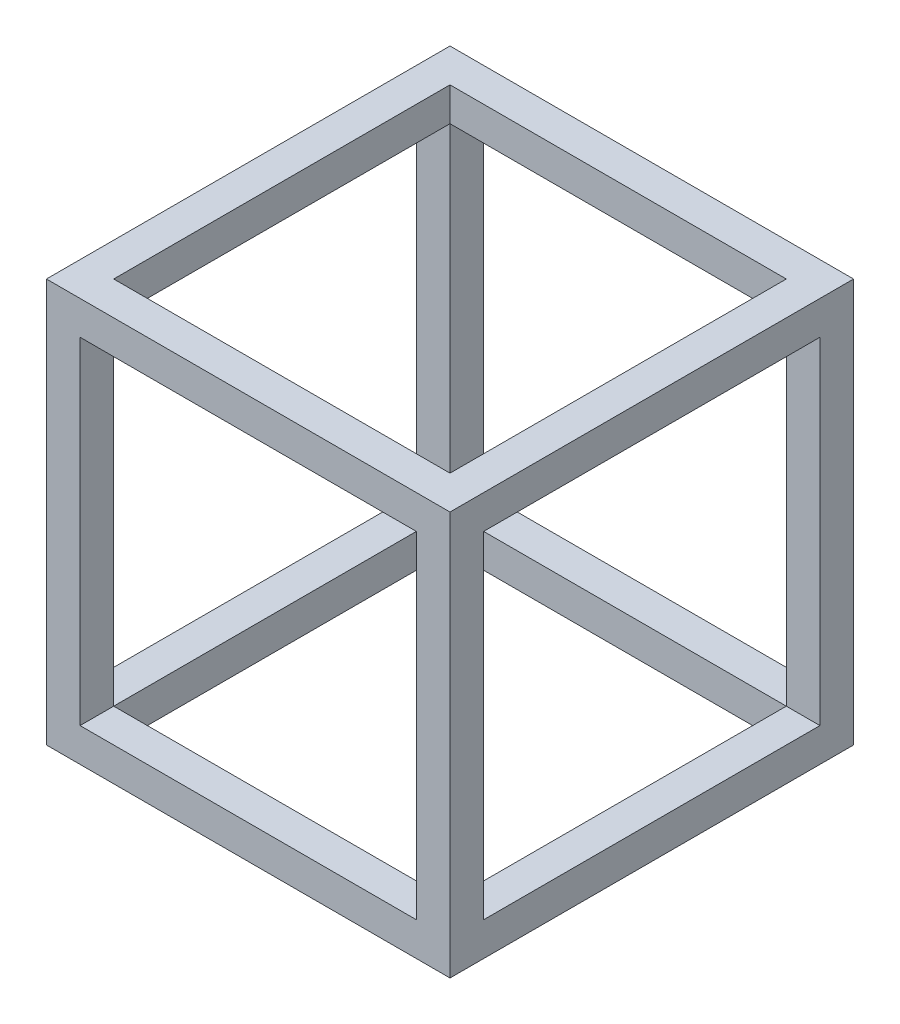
ISO-10303-21;
HEADER;
FILE_DESCRIPTION(('STEP AP214'),'2;1');
FILE_NAME('part.step','',(''),(''),'','','');
FILE_SCHEMA(('AUTOMOTIVE_DESIGN { 1 0 10303 214 1 1 1 1 }'));
ENDSEC;
DATA;
#1=APPLICATION_CONTEXT('core data for automotive mechanical design processes');
#2=APPLICATION_PROTOCOL_DEFINITION('international standard','automotive_design',2000,#1);
#3=PRODUCT_CONTEXT('',#1,'mechanical');
#4=PRODUCT('Part','Part','',(#3));
#5=PRODUCT_RELATED_PRODUCT_CATEGORY('part','',(#4));
#6=PRODUCT_DEFINITION_FORMATION('','',#4);
#7=PRODUCT_DEFINITION_CONTEXT('part definition',#1,'design');
#8=PRODUCT_DEFINITION('design','',#6,#7);
#9=PRODUCT_DEFINITION_SHAPE('','',#8);
#10=(LENGTH_UNIT() NAMED_UNIT(*) SI_UNIT(.MILLI.,.METRE.));
#11=(NAMED_UNIT(*) PLANE_ANGLE_UNIT() SI_UNIT($,.RADIAN.));
#12=(NAMED_UNIT(*) SI_UNIT($,.STERADIAN.) SOLID_ANGLE_UNIT());
#13=UNCERTAINTY_MEASURE_WITH_UNIT(LENGTH_MEASURE(1.E-05),#10,'distance_accuracy_value','');
#14=(GEOMETRIC_REPRESENTATION_CONTEXT(3) GLOBAL_UNCERTAINTY_ASSIGNED_CONTEXT((#13)) GLOBAL_UNIT_ASSIGNED_CONTEXT((#10,
#11,#12)) REPRESENTATION_CONTEXT('',''));
#15=CARTESIAN_POINT('',(0.,0.,0.));
#16=DIRECTION('',(0.,0.,1.));
#17=DIRECTION('',(1.,0.,0.));
#18=AXIS2_PLACEMENT_3D('',#15,#16,#17);
#19=CARTESIAN_POINT('',(-31.75,-38.1,31.75));
#20=DIRECTION('',(0.,0.,1.));
#21=DIRECTION('',(1.,0.,0.));
#22=AXIS2_PLACEMENT_3D('',#19,#20,#21);
#23=PLANE('',#22);
#24=DIRECTION('',(0.,1.,0.));
#25=VECTOR('',#24,1.);
#26=CARTESIAN_POINT('',(31.75,-38.1,31.75));
#27=LINE('',#26,#25);
#28=CARTESIAN_POINT('',(31.75,31.75,31.75));
#29=VERTEX_POINT('',#28);
#30=CARTESIAN_POINT('',(31.75,38.1,31.75));
#31=VERTEX_POINT('',#30);
#32=EDGE_CURVE('E312',#29,#31,#27,.T.);
#33=ORIENTED_EDGE('',*,*,#32,.F.);
#34=DIRECTION('',(-1.,0.,0.));
#35=VECTOR('',#34,1.);
#36=CARTESIAN_POINT('',(-31.75,31.75,31.75));
#37=LINE('',#36,#35);
#38=CARTESIAN_POINT('',(-31.75,31.75,31.75));
#39=VERTEX_POINT('',#38);
#40=EDGE_CURVE('E229',#29,#39,#37,.T.);
#41=ORIENTED_EDGE('',*,*,#40,.T.);
#42=DIRECTION('',(0.,1.,0.));
#43=VECTOR('',#42,1.);
#44=CARTESIAN_POINT('',(-31.75,-38.1,31.75));
#45=LINE('',#44,#43);
#46=CARTESIAN_POINT('',(-31.75,38.1,31.75));
#47=VERTEX_POINT('',#46);
#48=EDGE_CURVE('E316',#39,#47,#45,.T.);
#49=ORIENTED_EDGE('',*,*,#48,.T.);
#50=DIRECTION('',(1.,0.,0.));
#51=VECTOR('',#50,1.);
#52=CARTESIAN_POINT('',(-31.75,38.1,31.75));
#53=LINE('',#52,#51);
#54=EDGE_CURVE('E292',#47,#31,#53,.T.);
#55=ORIENTED_EDGE('',*,*,#54,.T.);
#56=EDGE_LOOP('',(#33,#41,#49,#55));
#57=FACE_BOUND('',#56,.T.);
#58=ADVANCED_FACE('F31',(#57),#23,.F.);
#59=DIRECTION('',(1.,0.,0.));
#60=VECTOR('',#59,1.);
#61=CARTESIAN_POINT('',(-38.1,-31.75,31.75));
#62=LINE('',#61,#60);
#63=CARTESIAN_POINT('',(31.75,-31.75,31.75));
#64=VERTEX_POINT('',#63);
#65=CARTESIAN_POINT('',(38.1,-31.75,31.75));
#66=VERTEX_POINT('',#65);
#67=EDGE_CURVE('E260',#64,#66,#62,.T.);
#68=ORIENTED_EDGE('',*,*,#67,.F.);
#69=DIRECTION('',(0.,1.,0.));
#70=VECTOR('',#69,1.);
#71=CARTESIAN_POINT('',(31.75,-38.1,31.75));
#72=LINE('',#71,#70);
#73=EDGE_CURVE('E220',#64,#29,#72,.T.);
#74=ORIENTED_EDGE('',*,*,#73,.T.);
#75=DIRECTION('',(1.,0.,0.));
#76=VECTOR('',#75,1.);
#77=CARTESIAN_POINT('',(-38.1,31.75,31.75));
#78=LINE('',#77,#76);
#79=CARTESIAN_POINT('',(38.1,31.75,31.75));
#80=VERTEX_POINT('',#79);
#81=EDGE_CURVE('E264',#29,#80,#78,.T.);
#82=ORIENTED_EDGE('',*,*,#81,.T.);
#83=DIRECTION('',(0.,-1.,0.));
#84=VECTOR('',#83,1.);
#85=CARTESIAN_POINT('',(38.1,31.75,31.75));
#86=LINE('',#85,#84);
#87=EDGE_CURVE('E240',#80,#66,#86,.T.);
#88=ORIENTED_EDGE('',*,*,#87,.T.);
#89=EDGE_LOOP('',(#68,#74,#82,#88));
#90=FACE_BOUND('',#89,.T.);
#91=ADVANCED_FACE('F381',(#90),#23,.F.);
#92=CARTESIAN_POINT('',(-31.75,-38.1,31.75));
#93=VERTEX_POINT('',#92);
#94=CARTESIAN_POINT('',(-31.75,-31.75,31.75));
#95=VERTEX_POINT('',#94);
#96=EDGE_CURVE('E313',#93,#95,#45,.T.);
#97=ORIENTED_EDGE('',*,*,#96,.T.);
#98=DIRECTION('',(1.,0.,0.));
#99=VECTOR('',#98,1.);
#100=CARTESIAN_POINT('',(-31.75,-31.75,31.75));
#101=LINE('',#100,#99);
#102=EDGE_CURVE('E178',#95,#64,#101,.T.);
#103=ORIENTED_EDGE('',*,*,#102,.T.);
#104=CARTESIAN_POINT('',(31.75,-38.1,31.75));
#105=VERTEX_POINT('',#104);
#106=EDGE_CURVE('E308',#105,#64,#27,.T.);
#107=ORIENTED_EDGE('',*,*,#106,.F.);
#108=DIRECTION('',(1.,0.,0.));
#109=VECTOR('',#108,1.);
#110=CARTESIAN_POINT('',(-31.75,-38.1,31.75));
#111=LINE('',#110,#109);
#112=EDGE_CURVE('E304',#93,#105,#111,.T.);
#113=ORIENTED_EDGE('',*,*,#112,.F.);
#114=EDGE_LOOP('',(#97,#103,#107,#113));
#115=FACE_BOUND('',#114,.T.);
#116=ADVANCED_FACE('F448',(#115),#23,.F.);
#117=CARTESIAN_POINT('',(31.75,-38.1,-31.75));
#118=DIRECTION('',(0.,0.,-1.));
#119=DIRECTION('',(-1.,0.,0.));
#120=AXIS2_PLACEMENT_3D('',#117,#118,#119);
#121=PLANE('',#120);
#122=DIRECTION('',(0.,1.,0.));
#123=VECTOR('',#122,1.);
#124=CARTESIAN_POINT('',(-31.75,-38.1,-31.75));
#125=LINE('',#124,#123);
#126=CARTESIAN_POINT('',(-31.75,31.75,-31.75));
#127=VERTEX_POINT('',#126);
#128=CARTESIAN_POINT('',(-31.75,38.1,-31.75));
#129=VERTEX_POINT('',#128);
#130=EDGE_CURVE('E320',#127,#129,#125,.T.);
#131=ORIENTED_EDGE('',*,*,#130,.F.);
#132=DIRECTION('',(1.,0.,0.));
#133=VECTOR('',#132,1.);
#134=CARTESIAN_POINT('',(31.75,31.75,-31.75));
#135=LINE('',#134,#133);
#136=CARTESIAN_POINT('',(31.75,31.75,-31.75));
#137=VERTEX_POINT('',#136);
#138=EDGE_CURVE('E11',#127,#137,#135,.T.);
#139=ORIENTED_EDGE('',*,*,#138,.T.);
#140=DIRECTION('',(0.,1.,0.));
#141=VECTOR('',#140,1.);
#142=CARTESIAN_POINT('',(31.75,-38.1,-31.75));
#143=LINE('',#142,#141);
#144=CARTESIAN_POINT('',(31.75,38.1,-31.75));
#145=VERTEX_POINT('',#144);
#146=EDGE_CURVE('E307',#137,#145,#143,.T.);
#147=ORIENTED_EDGE('',*,*,#146,.T.);
#148=DIRECTION('',(-1.,0.,0.));
#149=VECTOR('',#148,1.);
#150=CARTESIAN_POINT('',(31.75,38.1,-31.75));
#151=LINE('',#150,#149);
#152=EDGE_CURVE('E286',#145,#129,#151,.T.);
#153=ORIENTED_EDGE('',*,*,#152,.T.);
#154=EDGE_LOOP('',(#131,#139,#147,#153));
#155=FACE_BOUND('',#154,.T.);
#156=ADVANCED_FACE('F403',(#155),#121,.F.);
#157=DIRECTION('',(1.,0.,0.));
#158=VECTOR('',#157,1.);
#159=CARTESIAN_POINT('',(-38.1,31.75,-31.75));
#160=LINE('',#159,#158);
#161=CARTESIAN_POINT('',(38.1,31.75,-31.75));
#162=VERTEX_POINT('',#161);
#163=EDGE_CURVE('E268',#137,#162,#160,.T.);
#164=ORIENTED_EDGE('',*,*,#163,.F.);
#165=DIRECTION('',(0.,-1.,0.));
#166=VECTOR('',#165,1.);
#167=CARTESIAN_POINT('',(31.75,-38.1,-31.75));
#168=LINE('',#167,#166);
#169=CARTESIAN_POINT('',(31.75,-31.75,-31.75));
#170=VERTEX_POINT('',#169);
#171=EDGE_CURVE('E211',#137,#170,#168,.T.);
#172=ORIENTED_EDGE('',*,*,#171,.T.);
#173=DIRECTION('',(1.,0.,0.));
#174=VECTOR('',#173,1.);
#175=CARTESIAN_POINT('',(-38.1,-31.75,-31.75));
#176=LINE('',#175,#174);
#177=CARTESIAN_POINT('',(38.1,-31.75,-31.75));
#178=VERTEX_POINT('',#177);
#179=EDGE_CURVE('E255',#170,#178,#176,.T.);
#180=ORIENTED_EDGE('',*,*,#179,.T.);
#181=DIRECTION('',(0.,1.,0.));
#182=VECTOR('',#181,1.);
#183=CARTESIAN_POINT('',(38.1,-31.75,-31.75));
#184=LINE('',#183,#182);
#185=EDGE_CURVE('E234',#178,#162,#184,.T.);
#186=ORIENTED_EDGE('',*,*,#185,.T.);
#187=EDGE_LOOP('',(#164,#172,#180,#186));
#188=FACE_BOUND('',#187,.T.);
#189=ADVANCED_FACE('F392',(#188),#121,.F.);
#190=CARTESIAN_POINT('',(31.75,-38.1,-31.75));
#191=VERTEX_POINT('',#190);
#192=EDGE_CURVE('E321',#191,#170,#143,.T.);
#193=ORIENTED_EDGE('',*,*,#192,.T.);
#194=DIRECTION('',(-1.,0.,0.));
#195=VECTOR('',#194,1.);
#196=CARTESIAN_POINT('',(31.75,-31.75,-31.75));
#197=LINE('',#196,#195);
#198=CARTESIAN_POINT('',(-31.75,-31.75,-31.75));
#199=VERTEX_POINT('',#198);
#200=EDGE_CURVE('E39',#170,#199,#197,.T.);
#201=ORIENTED_EDGE('',*,*,#200,.T.);
#202=CARTESIAN_POINT('',(-31.75,-38.1,-31.75));
#203=VERTEX_POINT('',#202);
#204=EDGE_CURVE('E317',#203,#199,#125,.T.);
#205=ORIENTED_EDGE('',*,*,#204,.F.);
#206=DIRECTION('',(-1.,0.,0.));
#207=VECTOR('',#206,1.);
#208=CARTESIAN_POINT('',(31.75,-38.1,-31.75));
#209=LINE('',#208,#207);
#210=EDGE_CURVE('E298',#191,#203,#209,.T.);
#211=ORIENTED_EDGE('',*,*,#210,.F.);
#212=EDGE_LOOP('',(#193,#201,#205,#211));
#213=FACE_BOUND('',#212,.T.);
#214=ADVANCED_FACE('F355',(#213),#121,.F.);
#215=CARTESIAN_POINT('',(31.75,-38.1,31.75));
#216=DIRECTION('',(1.,0.,0.));
#217=DIRECTION('',(0.,0.,-1.));
#218=AXIS2_PLACEMENT_3D('',#215,#216,#217);
#219=PLANE('',#218);
#220=ORIENTED_EDGE('',*,*,#106,.T.);
#221=DIRECTION('',(0.,0.,-1.));
#222=VECTOR('',#221,1.);
#223=CARTESIAN_POINT('',(31.75,-31.75,31.75));
#224=LINE('',#223,#222);
#225=EDGE_CURVE('E280',#64,#170,#224,.T.);
#226=ORIENTED_EDGE('',*,*,#225,.T.);
#227=ORIENTED_EDGE('',*,*,#192,.F.);
#228=DIRECTION('',(0.,0.,-1.));
#229=VECTOR('',#228,1.);
#230=CARTESIAN_POINT('',(31.75,-38.1,31.75));
#231=LINE('',#230,#229);
#232=EDGE_CURVE('E295',#105,#191,#231,.T.);
#233=ORIENTED_EDGE('',*,*,#232,.F.);
#234=EDGE_LOOP('',(#220,#226,#227,#233));
#235=FACE_BOUND('',#234,.T.);
#236=ADVANCED_FACE('F373',(#235),#219,.F.);
#237=CARTESIAN_POINT('',(-31.75,-38.1,-31.75));
#238=DIRECTION('',(-1.,0.,0.));
#239=DIRECTION('',(0.,0.,1.));
#240=AXIS2_PLACEMENT_3D('',#237,#238,#239);
#241=PLANE('',#240);
#242=ORIENTED_EDGE('',*,*,#204,.T.);
#243=DIRECTION('',(0.,0.,1.));
#244=VECTOR('',#243,1.);
#245=CARTESIAN_POINT('',(-31.75,-31.75,-31.75));
#246=LINE('',#245,#244);
#247=EDGE_CURVE('E277',#199,#95,#246,.T.);
#248=ORIENTED_EDGE('',*,*,#247,.T.);
#249=ORIENTED_EDGE('',*,*,#96,.F.);
#250=DIRECTION('',(0.,0.,1.));
#251=VECTOR('',#250,1.);
#252=CARTESIAN_POINT('',(-31.75,-38.1,-31.75));
#253=LINE('',#252,#251);
#254=EDGE_CURVE('E301',#203,#93,#253,.T.);
#255=ORIENTED_EDGE('',*,*,#254,.F.);
#256=EDGE_LOOP('',(#242,#248,#249,#255));
#257=FACE_BOUND('',#256,.T.);
#258=ADVANCED_FACE('F366',(#257),#241,.F.);
#259=CARTESIAN_POINT('',(-38.1,-38.1,38.1));
#260=DIRECTION('',(1.,0.,0.));
#261=DIRECTION('',(0.,0.,-1.));
#262=AXIS2_PLACEMENT_3D('',#259,#260,#261);
#263=PLANE('',#262);
#264=DIRECTION('',(0.,-1.,0.));
#265=VECTOR('',#264,1.);
#266=CARTESIAN_POINT('',(-38.1,31.75,31.75));
#267=LINE('',#266,#265);
#268=CARTESIAN_POINT('',(-38.1,31.75,31.75));
#269=VERTEX_POINT('',#268);
#270=CARTESIAN_POINT('',(-38.1,-31.75,31.75));
#271=VERTEX_POINT('',#270);
#272=EDGE_CURVE('E252',#269,#271,#267,.T.);
#273=ORIENTED_EDGE('',*,*,#272,.T.);
#274=DIRECTION('',(0.,0.,-1.));
#275=VECTOR('',#274,1.);
#276=CARTESIAN_POINT('',(-38.1,-31.75,31.75));
#277=LINE('',#276,#275);
#278=CARTESIAN_POINT('',(-38.1,-31.75,-31.75));
#279=VERTEX_POINT('',#278);
#280=EDGE_CURVE('E243',#271,#279,#277,.T.);
#281=ORIENTED_EDGE('',*,*,#280,.T.);
#282=DIRECTION('',(0.,1.,0.));
#283=VECTOR('',#282,1.);
#284=CARTESIAN_POINT('',(-38.1,-31.75,-31.75));
#285=LINE('',#284,#283);
#286=CARTESIAN_POINT('',(-38.1,31.75,-31.75));
#287=VERTEX_POINT('',#286);
#288=EDGE_CURVE('E246',#279,#287,#285,.T.);
#289=ORIENTED_EDGE('',*,*,#288,.T.);
#290=DIRECTION('',(0.,0.,1.));
#291=VECTOR('',#290,1.);
#292=CARTESIAN_POINT('',(-38.1,31.75,-31.75));
#293=LINE('',#292,#291);
#294=EDGE_CURVE('E249',#287,#269,#293,.T.);
#295=ORIENTED_EDGE('',*,*,#294,.T.);
#296=EDGE_LOOP('',(#273,#281,#289,#295));
#297=FACE_BOUND('',#296,.T.);
#298=DIRECTION('',(0.,-1.,0.));
#299=VECTOR('',#298,1.);
#300=CARTESIAN_POINT('',(-38.1,-38.1,-38.1));
#301=LINE('',#300,#299);
#302=CARTESIAN_POINT('',(-38.1,38.1,-38.1));
#303=VERTEX_POINT('',#302);
#304=CARTESIAN_POINT('',(-38.1,-38.1,-38.1));
#305=VERTEX_POINT('',#304);
#306=EDGE_CURVE('E311',#303,#305,#301,.T.);
#307=ORIENTED_EDGE('',*,*,#306,.T.);
#308=DIRECTION('',(0.,0.,-1.));
#309=VECTOR('',#308,1.);
#310=CARTESIAN_POINT('',(-38.1,-38.1,38.1));
#311=LINE('',#310,#309);
#312=CARTESIAN_POINT('',(-38.1,-38.1,38.1));
#313=VERTEX_POINT('',#312);
#314=EDGE_CURVE('E350',#313,#305,#311,.T.);
#315=ORIENTED_EDGE('',*,*,#314,.F.);
#316=DIRECTION('',(0.,-1.,0.));
#317=VECTOR('',#316,1.);
#318=CARTESIAN_POINT('',(-38.1,-38.1,38.1));
#319=LINE('',#318,#317);
#320=CARTESIAN_POINT('',(-38.1,38.1,38.1));
#321=VERTEX_POINT('',#320);
#322=EDGE_CURVE('E332',#321,#313,#319,.T.);
#323=ORIENTED_EDGE('',*,*,#322,.F.);
#324=DIRECTION('',(0.,0.,-1.));
#325=VECTOR('',#324,1.);
#326=CARTESIAN_POINT('',(-38.1,38.1,38.1));
#327=LINE('',#326,#325);
#328=EDGE_CURVE('E341',#321,#303,#327,.T.);
#329=ORIENTED_EDGE('',*,*,#328,.T.);
#330=EDGE_LOOP('',(#307,#315,#323,#329));
#331=FACE_BOUND('',#330,.T.);
#332=ADVANCED_FACE('F33',(#297,#331),#263,.F.);
#333=CARTESIAN_POINT('',(-38.1,-38.1,38.1));
#334=DIRECTION('',(0.,1.,0.));
#335=DIRECTION('',(0.,0.,1.));
#336=AXIS2_PLACEMENT_3D('',#333,#334,#335);
#337=PLANE('',#336);
#338=ORIENTED_EDGE('',*,*,#112,.T.);
#339=ORIENTED_EDGE('',*,*,#232,.T.);
#340=ORIENTED_EDGE('',*,*,#210,.T.);
#341=ORIENTED_EDGE('',*,*,#254,.T.);
#342=EDGE_LOOP('',(#338,#339,#340,#341));
#343=FACE_BOUND('',#342,.T.);
#344=DIRECTION('',(1.,0.,0.));
#345=VECTOR('',#344,1.);
#346=CARTESIAN_POINT('',(-38.1,-38.1,-38.1));
#347=LINE('',#346,#345);
#348=CARTESIAN_POINT('',(38.1,-38.1,-38.1));
#349=VERTEX_POINT('',#348);
#350=EDGE_CURVE('E326',#305,#349,#347,.T.);
#351=ORIENTED_EDGE('',*,*,#350,.T.);
#352=DIRECTION('',(0.,0.,-1.));
#353=VECTOR('',#352,1.);
#354=CARTESIAN_POINT('',(38.1,-38.1,38.1));
#355=LINE('',#354,#353);
#356=CARTESIAN_POINT('',(38.1,-38.1,38.1));
#357=VERTEX_POINT('',#356);
#358=EDGE_CURVE('E347',#357,#349,#355,.T.);
#359=ORIENTED_EDGE('',*,*,#358,.F.);
#360=DIRECTION('',(1.,0.,0.));
#361=VECTOR('',#360,1.);
#362=CARTESIAN_POINT('',(-38.1,-38.1,38.1));
#363=LINE('',#362,#361);
#364=EDGE_CURVE('E335',#313,#357,#363,.T.);
#365=ORIENTED_EDGE('',*,*,#364,.F.);
#366=ORIENTED_EDGE('',*,*,#314,.T.);
#367=EDGE_LOOP('',(#351,#359,#365,#366));
#368=FACE_BOUND('',#367,.T.);
#369=ADVANCED_FACE('F369',(#343,#368),#337,.F.);
#370=CARTESIAN_POINT('',(38.1,-38.1,38.1));
#371=DIRECTION('',(-1.,0.,0.));
#372=DIRECTION('',(0.,0.,1.));
#373=AXIS2_PLACEMENT_3D('',#370,#371,#372);
#374=PLANE('',#373);
#375=ORIENTED_EDGE('',*,*,#185,.F.);
#376=DIRECTION('',(0.,0.,-1.));
#377=VECTOR('',#376,1.);
#378=CARTESIAN_POINT('',(38.1,-31.75,31.75));
#379=LINE('',#378,#377);
#380=EDGE_CURVE('E232',#66,#178,#379,.T.);
#381=ORIENTED_EDGE('',*,*,#380,.F.);
#382=ORIENTED_EDGE('',*,*,#87,.F.);
#383=DIRECTION('',(0.,0.,1.));
#384=VECTOR('',#383,1.);
#385=CARTESIAN_POINT('',(38.1,31.75,-31.75));
#386=LINE('',#385,#384);
#387=EDGE_CURVE('E237',#162,#80,#386,.T.);
#388=ORIENTED_EDGE('',*,*,#387,.F.);
#389=EDGE_LOOP('',(#375,#381,#382,#388));
#390=FACE_BOUND('',#389,.T.);
#391=DIRECTION('',(0.,1.,0.));
#392=VECTOR('',#391,1.);
#393=CARTESIAN_POINT('',(38.1,-38.1,-38.1));
#394=LINE('',#393,#392);
#395=CARTESIAN_POINT('',(38.1,38.1,-38.1));
#396=VERTEX_POINT('',#395);
#397=EDGE_CURVE('E328',#349,#396,#394,.T.);
#398=ORIENTED_EDGE('',*,*,#397,.T.);
#399=DIRECTION('',(0.,0.,-1.));
#400=VECTOR('',#399,1.);
#401=CARTESIAN_POINT('',(38.1,38.1,38.1));
#402=LINE('',#401,#400);
#403=CARTESIAN_POINT('',(38.1,38.1,38.1));
#404=VERTEX_POINT('',#403);
#405=EDGE_CURVE('E344',#404,#396,#402,.T.);
#406=ORIENTED_EDGE('',*,*,#405,.F.);
#407=DIRECTION('',(0.,1.,0.));
#408=VECTOR('',#407,1.);
#409=CARTESIAN_POINT('',(38.1,-38.1,38.1));
#410=LINE('',#409,#408);
#411=EDGE_CURVE('E337',#357,#404,#410,.T.);
#412=ORIENTED_EDGE('',*,*,#411,.F.);
#413=ORIENTED_EDGE('',*,*,#358,.T.);
#414=EDGE_LOOP('',(#398,#406,#412,#413));
#415=FACE_BOUND('',#414,.T.);
#416=ADVANCED_FACE('F388',(#390,#415),#374,.F.);
#417=CARTESIAN_POINT('',(-38.1,38.1,38.1));
#418=DIRECTION('',(0.,-1.,0.));
#419=DIRECTION('',(0.,0.,-1.));
#420=AXIS2_PLACEMENT_3D('',#417,#418,#419);
#421=PLANE('',#420);
#422=ORIENTED_EDGE('',*,*,#152,.F.);
#423=DIRECTION('',(0.,0.,-1.));
#424=VECTOR('',#423,1.);
#425=CARTESIAN_POINT('',(31.75,38.1,31.75));
#426=LINE('',#425,#424);
#427=EDGE_CURVE('E283',#31,#145,#426,.T.);
#428=ORIENTED_EDGE('',*,*,#427,.F.);
#429=ORIENTED_EDGE('',*,*,#54,.F.);
#430=DIRECTION('',(0.,0.,1.));
#431=VECTOR('',#430,1.);
#432=CARTESIAN_POINT('',(-31.75,38.1,-31.75));
#433=LINE('',#432,#431);
#434=EDGE_CURVE('E289',#129,#47,#433,.T.);
#435=ORIENTED_EDGE('',*,*,#434,.F.);
#436=EDGE_LOOP('',(#422,#428,#429,#435));
#437=FACE_BOUND('',#436,.T.);
#438=DIRECTION('',(-1.,0.,0.));
#439=VECTOR('',#438,1.);
#440=CARTESIAN_POINT('',(-38.1,38.1,-38.1));
#441=LINE('',#440,#439);
#442=EDGE_CURVE('E330',#396,#303,#441,.T.);
#443=ORIENTED_EDGE('',*,*,#442,.T.);
#444=ORIENTED_EDGE('',*,*,#328,.F.);
#445=DIRECTION('',(-1.,0.,0.));
#446=VECTOR('',#445,1.);
#447=CARTESIAN_POINT('',(-38.1,38.1,38.1));
#448=LINE('',#447,#446);
#449=EDGE_CURVE('E339',#404,#321,#448,.T.);
#450=ORIENTED_EDGE('',*,*,#449,.F.);
#451=ORIENTED_EDGE('',*,*,#405,.T.);
#452=EDGE_LOOP('',(#443,#444,#450,#451));
#453=FACE_BOUND('',#452,.T.);
#454=ADVANCED_FACE('F433',(#437,#453),#421,.F.);
#455=CARTESIAN_POINT('',(-38.1,38.1,38.1));
#456=DIRECTION('',(0.,0.,-1.));
#457=DIRECTION('',(-1.,0.,0.));
#458=AXIS2_PLACEMENT_3D('',#455,#456,#457);
#459=PLANE('',#458);
#460=DIRECTION('',(0.,-1.,0.));
#461=VECTOR('',#460,1.);
#462=CARTESIAN_POINT('',(-31.75,31.75,38.1));
#463=LINE('',#462,#461);
#464=CARTESIAN_POINT('',(-31.75,31.75,38.1));
#465=VERTEX_POINT('',#464);
#466=CARTESIAN_POINT('',(-31.75,-31.75,38.1));
#467=VERTEX_POINT('',#466);
#468=EDGE_CURVE('E185',#465,#467,#463,.T.);
#469=ORIENTED_EDGE('',*,*,#468,.F.);
#470=DIRECTION('',(-1.,0.,0.));
#471=VECTOR('',#470,1.);
#472=CARTESIAN_POINT('',(31.75,31.75,38.1));
#473=LINE('',#472,#471);
#474=CARTESIAN_POINT('',(31.75,31.75,38.1));
#475=VERTEX_POINT('',#474);
#476=EDGE_CURVE('E46',#475,#465,#473,.T.);
#477=ORIENTED_EDGE('',*,*,#476,.F.);
#478=DIRECTION('',(0.,1.,0.));
#479=VECTOR('',#478,1.);
#480=CARTESIAN_POINT('',(31.75,-31.75,38.1));
#481=LINE('',#480,#479);
#482=CARTESIAN_POINT('',(31.75,-31.75,38.1));
#483=VERTEX_POINT('',#482);
#484=EDGE_CURVE('E193',#483,#475,#481,.T.);
#485=ORIENTED_EDGE('',*,*,#484,.F.);
#486=DIRECTION('',(1.,0.,0.));
#487=VECTOR('',#486,1.);
#488=CARTESIAN_POINT('',(-31.75,-31.75,38.1));
#489=LINE('',#488,#487);
#490=EDGE_CURVE('E175',#467,#483,#489,.T.);
#491=ORIENTED_EDGE('',*,*,#490,.F.);
#492=EDGE_LOOP('',(#469,#477,#485,#491));
#493=FACE_BOUND('',#492,.T.);
#494=ORIENTED_EDGE('',*,*,#322,.T.);
#495=ORIENTED_EDGE('',*,*,#364,.T.);
#496=ORIENTED_EDGE('',*,*,#411,.T.);
#497=ORIENTED_EDGE('',*,*,#449,.T.);
#498=EDGE_LOOP('',(#494,#495,#496,#497));
#499=FACE_BOUND('',#498,.T.);
#500=ADVANCED_FACE('F190',(#493,#499),#459,.F.);
#501=CARTESIAN_POINT('',(-38.1,38.1,-38.1));
#502=DIRECTION('',(0.,0.,-1.));
#503=DIRECTION('',(-1.,0.,0.));
#504=AXIS2_PLACEMENT_3D('',#501,#502,#503);
#505=PLANE('',#504);
#506=DIRECTION('',(-1.,0.,0.));
#507=VECTOR('',#506,1.);
#508=CARTESIAN_POINT('',(31.75,31.75,-38.1));
#509=LINE('',#508,#507);
#510=CARTESIAN_POINT('',(31.75,31.75,-38.1));
#511=VERTEX_POINT('',#510);
#512=CARTESIAN_POINT('',(-31.75,31.75,-38.1));
#513=VERTEX_POINT('',#512);
#514=EDGE_CURVE('E195',#511,#513,#509,.T.);
#515=ORIENTED_EDGE('',*,*,#514,.T.);
#516=DIRECTION('',(0.,-1.,0.));
#517=VECTOR('',#516,1.);
#518=CARTESIAN_POINT('',(-31.75,31.75,-38.1));
#519=LINE('',#518,#517);
#520=CARTESIAN_POINT('',(-31.75,-31.75,-38.1));
#521=VERTEX_POINT('',#520);
#522=EDGE_CURVE('E201',#513,#521,#519,.T.);
#523=ORIENTED_EDGE('',*,*,#522,.T.);
#524=DIRECTION('',(1.,0.,0.));
#525=VECTOR('',#524,1.);
#526=CARTESIAN_POINT('',(-31.75,-31.75,-38.1));
#527=LINE('',#526,#525);
#528=CARTESIAN_POINT('',(31.75,-31.75,-38.1));
#529=VERTEX_POINT('',#528);
#530=EDGE_CURVE('E54',#521,#529,#527,.T.);
#531=ORIENTED_EDGE('',*,*,#530,.T.);
#532=DIRECTION('',(0.,1.,0.));
#533=VECTOR('',#532,1.);
#534=CARTESIAN_POINT('',(31.75,-31.75,-38.1));
#535=LINE('',#534,#533);
#536=EDGE_CURVE('E205',#529,#511,#535,.T.);
#537=ORIENTED_EDGE('',*,*,#536,.T.);
#538=EDGE_LOOP('',(#515,#523,#531,#537));
#539=FACE_BOUND('',#538,.T.);
#540=ORIENTED_EDGE('',*,*,#306,.F.);
#541=ORIENTED_EDGE('',*,*,#442,.F.);
#542=ORIENTED_EDGE('',*,*,#397,.F.);
#543=ORIENTED_EDGE('',*,*,#350,.F.);
#544=EDGE_LOOP('',(#540,#541,#542,#543));
#545=FACE_BOUND('',#544,.T.);
#546=ADVANCED_FACE('F426',(#539,#545),#505,.T.);
#547=ORIENTED_EDGE('',*,*,#146,.F.);
#548=DIRECTION('',(0.,0.,1.));
#549=VECTOR('',#548,1.);
#550=CARTESIAN_POINT('',(31.75,31.75,31.75));
#551=LINE('',#550,#549);
#552=EDGE_CURVE('E274',#137,#29,#551,.T.);
#553=ORIENTED_EDGE('',*,*,#552,.T.);
#554=ORIENTED_EDGE('',*,*,#32,.T.);
#555=ORIENTED_EDGE('',*,*,#427,.T.);
#556=EDGE_LOOP('',(#547,#553,#554,#555));
#557=FACE_BOUND('',#556,.T.);
#558=ADVANCED_FACE('F453',(#557),#219,.F.);
#559=EDGE_CURVE('E261',#269,#39,#78,.T.);
#560=ORIENTED_EDGE('',*,*,#559,.T.);
#561=DIRECTION('',(0.,-1.,0.));
#562=VECTOR('',#561,1.);
#563=CARTESIAN_POINT('',(-31.75,-38.1,31.75));
#564=LINE('',#563,#562);
#565=EDGE_CURVE('E226',#39,#95,#564,.T.);
#566=ORIENTED_EDGE('',*,*,#565,.T.);
#567=EDGE_CURVE('E256',#271,#95,#62,.T.);
#568=ORIENTED_EDGE('',*,*,#567,.F.);
#569=ORIENTED_EDGE('',*,*,#272,.F.);
#570=EDGE_LOOP('',(#560,#566,#568,#569));
#571=FACE_BOUND('',#570,.T.);
#572=ADVANCED_FACE('F416',(#571),#23,.F.);
#573=ORIENTED_EDGE('',*,*,#48,.F.);
#574=DIRECTION('',(0.,0.,-1.));
#575=VECTOR('',#574,1.);
#576=CARTESIAN_POINT('',(-31.75,31.75,-31.75));
#577=LINE('',#576,#575);
#578=EDGE_CURVE('E259',#39,#127,#577,.T.);
#579=ORIENTED_EDGE('',*,*,#578,.T.);
#580=ORIENTED_EDGE('',*,*,#130,.T.);
#581=ORIENTED_EDGE('',*,*,#434,.T.);
#582=EDGE_LOOP('',(#573,#579,#580,#581));
#583=FACE_BOUND('',#582,.T.);
#584=ADVANCED_FACE('F409',(#583),#241,.F.);
#585=EDGE_CURVE('E269',#279,#199,#176,.T.);
#586=ORIENTED_EDGE('',*,*,#585,.T.);
#587=DIRECTION('',(0.,1.,0.));
#588=VECTOR('',#587,1.);
#589=CARTESIAN_POINT('',(-31.75,-38.1,-31.75));
#590=LINE('',#589,#588);
#591=EDGE_CURVE('E223',#199,#127,#590,.T.);
#592=ORIENTED_EDGE('',*,*,#591,.T.);
#593=EDGE_CURVE('E265',#287,#127,#160,.T.);
#594=ORIENTED_EDGE('',*,*,#593,.F.);
#595=ORIENTED_EDGE('',*,*,#288,.F.);
#596=EDGE_LOOP('',(#586,#592,#594,#595));
#597=FACE_BOUND('',#596,.T.);
#598=ADVANCED_FACE('F360',(#597),#121,.F.);
#599=CARTESIAN_POINT('',(-38.1,31.75,-31.75));
#600=DIRECTION('',(0.,1.,0.));
#601=DIRECTION('',(0.,0.,1.));
#602=AXIS2_PLACEMENT_3D('',#599,#600,#601);
#603=PLANE('',#602);
#604=ORIENTED_EDGE('',*,*,#559,.F.);
#605=ORIENTED_EDGE('',*,*,#294,.F.);
#606=ORIENTED_EDGE('',*,*,#593,.T.);
#607=ORIENTED_EDGE('',*,*,#578,.F.);
#608=EDGE_LOOP('',(#604,#605,#606,#607));
#609=FACE_BOUND('',#608,.T.);
#610=ADVANCED_FACE('F413',(#609),#603,.F.);
#611=CARTESIAN_POINT('',(-38.1,-31.75,31.75));
#612=DIRECTION('',(0.,-1.,0.));
#613=DIRECTION('',(0.,0.,-1.));
#614=AXIS2_PLACEMENT_3D('',#611,#612,#613);
#615=PLANE('',#614);
#616=ORIENTED_EDGE('',*,*,#585,.F.);
#617=ORIENTED_EDGE('',*,*,#280,.F.);
#618=ORIENTED_EDGE('',*,*,#567,.T.);
#619=ORIENTED_EDGE('',*,*,#247,.F.);
#620=EDGE_LOOP('',(#616,#617,#618,#619));
#621=FACE_BOUND('',#620,.T.);
#622=ADVANCED_FACE('F364',(#621),#615,.F.);
#623=ORIENTED_EDGE('',*,*,#67,.T.);
#624=ORIENTED_EDGE('',*,*,#380,.T.);
#625=ORIENTED_EDGE('',*,*,#179,.F.);
#626=ORIENTED_EDGE('',*,*,#225,.F.);
#627=EDGE_LOOP('',(#623,#624,#625,#626));
#628=FACE_BOUND('',#627,.T.);
#629=ADVANCED_FACE('F378',(#628),#615,.F.);
#630=ORIENTED_EDGE('',*,*,#163,.T.);
#631=ORIENTED_EDGE('',*,*,#387,.T.);
#632=ORIENTED_EDGE('',*,*,#81,.F.);
#633=ORIENTED_EDGE('',*,*,#552,.F.);
#634=EDGE_LOOP('',(#630,#631,#632,#633));
#635=FACE_BOUND('',#634,.T.);
#636=ADVANCED_FACE('F474',(#635),#603,.F.);
#637=CARTESIAN_POINT('',(-31.75,31.75,-38.1));
#638=DIRECTION('',(-1.,0.,0.));
#639=DIRECTION('',(0.,0.,1.));
#640=AXIS2_PLACEMENT_3D('',#637,#638,#639);
#641=PLANE('',#640);
#642=DIRECTION('',(0.,0.,1.));
#643=VECTOR('',#642,1.);
#644=CARTESIAN_POINT('',(-31.75,-31.75,-38.1));
#645=LINE('',#644,#643);
#646=EDGE_CURVE('E181',#521,#199,#645,.T.);
#647=ORIENTED_EDGE('',*,*,#646,.F.);
#648=ORIENTED_EDGE('',*,*,#522,.F.);
#649=DIRECTION('',(0.,0.,1.));
#650=VECTOR('',#649,1.);
#651=CARTESIAN_POINT('',(-31.75,31.75,-38.1));
#652=LINE('',#651,#650);
#653=EDGE_CURVE('E182',#513,#127,#652,.T.);
#654=ORIENTED_EDGE('',*,*,#653,.T.);
#655=ORIENTED_EDGE('',*,*,#591,.F.);
#656=EDGE_LOOP('',(#647,#648,#654,#655));
#657=FACE_BOUND('',#656,.T.);
#658=ADVANCED_FACE('F546',(#657),#641,.F.);
#659=CARTESIAN_POINT('',(-31.75,-31.75,-38.1));
#660=DIRECTION('',(0.,-1.,0.));
#661=DIRECTION('',(0.,0.,-1.));
#662=AXIS2_PLACEMENT_3D('',#659,#660,#661);
#663=PLANE('',#662);
#664=DIRECTION('',(0.,0.,1.));
#665=VECTOR('',#664,1.);
#666=CARTESIAN_POINT('',(31.75,-31.75,-38.1));
#667=LINE('',#666,#665);
#668=EDGE_CURVE('E213',#529,#170,#667,.T.);
#669=ORIENTED_EDGE('',*,*,#668,.F.);
#670=ORIENTED_EDGE('',*,*,#530,.F.);
#671=ORIENTED_EDGE('',*,*,#646,.T.);
#672=ORIENTED_EDGE('',*,*,#200,.F.);
#673=EDGE_LOOP('',(#669,#670,#671,#672));
#674=FACE_BOUND('',#673,.T.);
#675=ADVANCED_FACE('F556',(#674),#663,.F.);
#676=CARTESIAN_POINT('',(31.75,-31.75,-38.1));
#677=DIRECTION('',(1.,0.,0.));
#678=DIRECTION('',(0.,0.,-1.));
#679=AXIS2_PLACEMENT_3D('',#676,#677,#678);
#680=PLANE('',#679);
#681=DIRECTION('',(0.,0.,1.));
#682=VECTOR('',#681,1.);
#683=CARTESIAN_POINT('',(31.75,31.75,-38.1));
#684=LINE('',#683,#682);
#685=EDGE_CURVE('E208',#511,#137,#684,.T.);
#686=ORIENTED_EDGE('',*,*,#685,.F.);
#687=ORIENTED_EDGE('',*,*,#536,.F.);
#688=ORIENTED_EDGE('',*,*,#668,.T.);
#689=ORIENTED_EDGE('',*,*,#171,.F.);
#690=EDGE_LOOP('',(#686,#687,#688,#689));
#691=FACE_BOUND('',#690,.T.);
#692=ADVANCED_FACE('F395',(#691),#680,.F.);
#693=CARTESIAN_POINT('',(31.75,31.75,-38.1));
#694=DIRECTION('',(0.,1.,0.));
#695=DIRECTION('',(0.,0.,1.));
#696=AXIS2_PLACEMENT_3D('',#693,#694,#695);
#697=PLANE('',#696);
#698=ORIENTED_EDGE('',*,*,#653,.F.);
#699=ORIENTED_EDGE('',*,*,#514,.F.);
#700=ORIENTED_EDGE('',*,*,#685,.T.);
#701=ORIENTED_EDGE('',*,*,#138,.F.);
#702=EDGE_LOOP('',(#698,#699,#700,#701));
#703=FACE_BOUND('',#702,.T.);
#704=ADVANCED_FACE('F400',(#703),#697,.F.);
#705=EDGE_CURVE('E212',#29,#475,#684,.T.);
#706=ORIENTED_EDGE('',*,*,#705,.T.);
#707=ORIENTED_EDGE('',*,*,#476,.T.);
#708=EDGE_CURVE('E187',#39,#465,#652,.T.);
#709=ORIENTED_EDGE('',*,*,#708,.F.);
#710=ORIENTED_EDGE('',*,*,#40,.F.);
#711=EDGE_LOOP('',(#706,#707,#709,#710));
#712=FACE_BOUND('',#711,.T.);
#713=ADVANCED_FACE('F584',(#712),#697,.F.);
#714=EDGE_CURVE('E170',#95,#467,#645,.T.);
#715=ORIENTED_EDGE('',*,*,#714,.T.);
#716=ORIENTED_EDGE('',*,*,#490,.T.);
#717=EDGE_CURVE('E215',#64,#483,#667,.T.);
#718=ORIENTED_EDGE('',*,*,#717,.F.);
#719=ORIENTED_EDGE('',*,*,#102,.F.);
#720=EDGE_LOOP('',(#715,#716,#718,#719));
#721=FACE_BOUND('',#720,.T.);
#722=ADVANCED_FACE('F172',(#721),#663,.F.);
#723=ORIENTED_EDGE('',*,*,#708,.T.);
#724=ORIENTED_EDGE('',*,*,#468,.T.);
#725=ORIENTED_EDGE('',*,*,#714,.F.);
#726=ORIENTED_EDGE('',*,*,#565,.F.);
#727=EDGE_LOOP('',(#723,#724,#725,#726));
#728=FACE_BOUND('',#727,.T.);
#729=ADVANCED_FACE('F186',(#728),#641,.F.);
#730=ORIENTED_EDGE('',*,*,#717,.T.);
#731=ORIENTED_EDGE('',*,*,#484,.T.);
#732=ORIENTED_EDGE('',*,*,#705,.F.);
#733=ORIENTED_EDGE('',*,*,#73,.F.);
#734=EDGE_LOOP('',(#730,#731,#732,#733));
#735=FACE_BOUND('',#734,.T.);
#736=ADVANCED_FACE('F576',(#735),#680,.F.);
#737=CLOSED_SHELL('',(#58,#91,#116,#156,#189,#214,#236,#258,#332,#369,#416,#454,#500,#546,#558,
#572,#584,#598,#610,#622,#629,#636,#658,#675,#692,#704,#713,#722,#729,#736));
#738=MANIFOLD_SOLID_BREP('B2',#737);
#739=ADVANCED_BREP_SHAPE_REPRESENTATION('',(#18,#738),#14);
#740=SHAPE_DEFINITION_REPRESENTATION(#9,#739);
ENDSEC;
END-ISO-10303-21;
